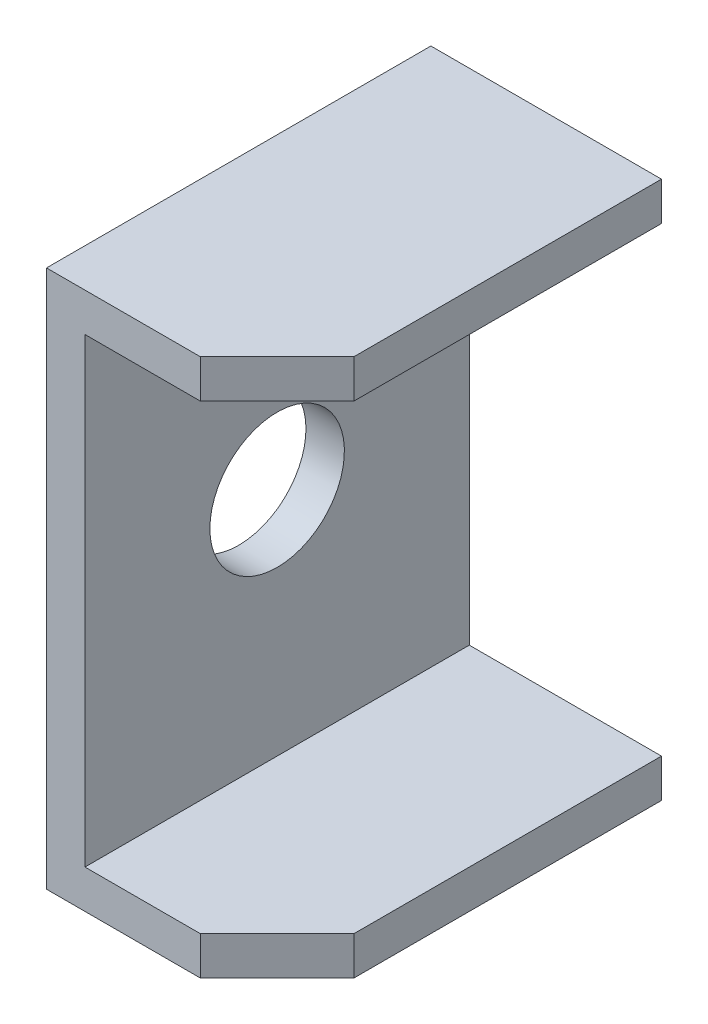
from build123d import *

# Parameters (mm, degrees)
BASE_EXTRUSION_DEPTH    = 100
ESQUISSE2_R             = 17.5
ENL_V_MAT_EXTRU_1_DEPTH = 20
CHANFREIN1_SIZE         = 20


with BuildPart() as part:
    # Esquisse1 → Base-Extrusion (new body)
    with BuildSketch(Plane.XY):
        Polygon((0, 0), (60, 0), (60, -10), (10, -10), (10, -130), (60, -130), (60, -140), (0, -140), align=None)
    extrude(amount=BASE_EXTRUSION_DEPTH)

    # Esquisse2 → Enl_v. mat.-Extru.1 (cut)
    with BuildSketch(Plane.ZY):
        with Locations(Location((50, -70, 0), (0, 0, 270))):
            Circle(ESQUISSE2_R)
    extrude(amount=-ENL_V_MAT_EXTRU_1_DEPTH, mode=Mode.SUBTRACT)

    # Chanfrein1
    chanfrein1_edges = [part.edges().sort_by_distance(p)[0] for p in [
        (60, -5, 100),
        (60, -135, 100),
    ]]
    chamfer(chanfrein1_edges, length=CHANFREIN1_SIZE)


solid = part.part
